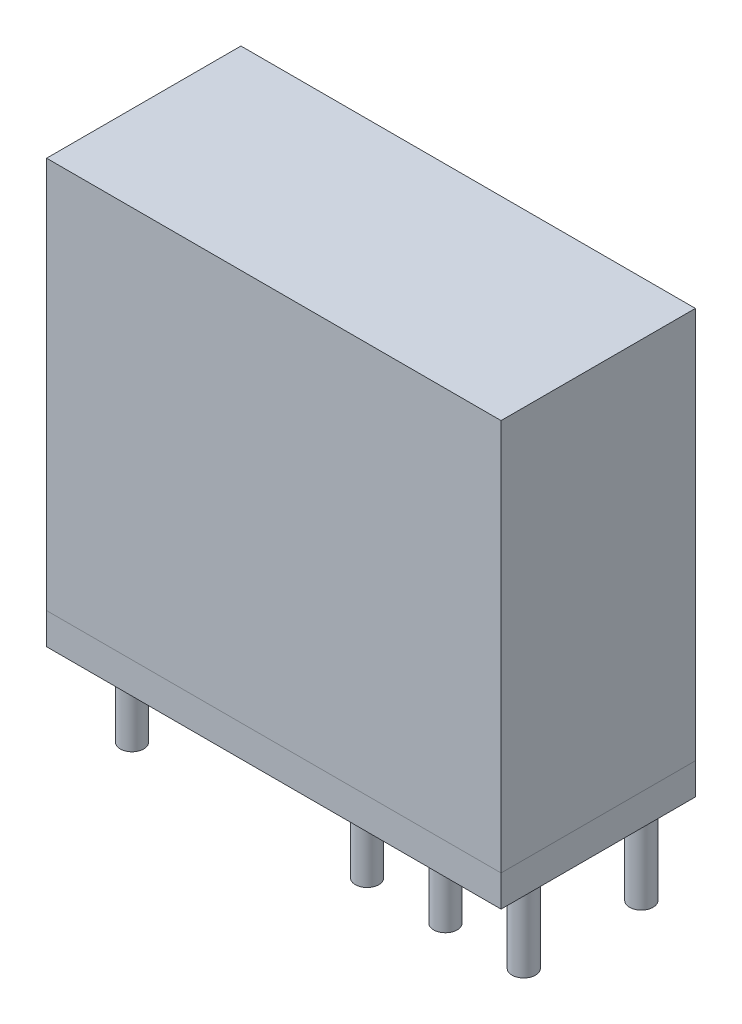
ISO-10303-21;
HEADER;
FILE_DESCRIPTION(('STEP AP214'),'2;1');
FILE_NAME('part.step','',(''),(''),'','','');
FILE_SCHEMA(('AUTOMOTIVE_DESIGN { 1 0 10303 214 1 1 1 1 }'));
ENDSEC;
DATA;
#1=APPLICATION_CONTEXT('core data for automotive mechanical design processes');
#2=APPLICATION_PROTOCOL_DEFINITION('international standard','automotive_design',2000,#1);
#3=PRODUCT_CONTEXT('',#1,'mechanical');
#4=PRODUCT('Part','Part','',(#3));
#5=PRODUCT_RELATED_PRODUCT_CATEGORY('part','',(#4));
#6=PRODUCT_DEFINITION_FORMATION('','',#4);
#7=PRODUCT_DEFINITION_CONTEXT('part definition',#1,'design');
#8=PRODUCT_DEFINITION('design','',#6,#7);
#9=PRODUCT_DEFINITION_SHAPE('','',#8);
#10=(LENGTH_UNIT() NAMED_UNIT(*) SI_UNIT(.MILLI.,.METRE.));
#11=(NAMED_UNIT(*) PLANE_ANGLE_UNIT() SI_UNIT($,.RADIAN.));
#12=(NAMED_UNIT(*) SI_UNIT($,.STERADIAN.) SOLID_ANGLE_UNIT());
#13=UNCERTAINTY_MEASURE_WITH_UNIT(LENGTH_MEASURE(1.E-05),#10,'distance_accuracy_value','');
#14=(GEOMETRIC_REPRESENTATION_CONTEXT(3) GLOBAL_UNCERTAINTY_ASSIGNED_CONTEXT((#13)) GLOBAL_UNIT_ASSIGNED_CONTEXT((#10,
#11,#12)) REPRESENTATION_CONTEXT('',''));
#15=CARTESIAN_POINT('',(0.,0.,0.));
#16=DIRECTION('',(0.,0.,1.));
#17=DIRECTION('',(1.,0.,0.));
#18=AXIS2_PLACEMENT_3D('',#15,#16,#17);
#19=CARTESIAN_POINT('',(0.,0.,0.));
#20=DIRECTION('',(0.,1.,0.));
#21=DIRECTION('',(0.,0.,1.));
#22=AXIS2_PLACEMENT_3D('',#19,#20,#21);
#23=PLANE('',#22);
#24=CARTESIAN_POINT('',(18.,0.,-9.95));
#25=DIRECTION('',(0.,1.,0.));
#26=DIRECTION('',(0.,0.,1.));
#27=AXIS2_PLACEMENT_3D('',#24,#25,#26);
#28=CIRCLE('',#27,0.750000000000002);
#29=CARTESIAN_POINT('',(18.,0.,-9.2));
#30=VERTEX_POINT('',#29);
#31=EDGE_CURVE('E49',#30,#30,#28,.F.);
#32=ORIENTED_EDGE('',*,*,#31,.F.);
#33=EDGE_LOOP('',(#32));
#34=FACE_BOUND('',#33,.T.);
#35=CARTESIAN_POINT('',(28.,0.,-9.95));
#36=DIRECTION('',(0.,1.,0.));
#37=DIRECTION('',(0.,0.,1.));
#38=AXIS2_PLACEMENT_3D('',#35,#36,#37);
#39=CIRCLE('',#38,0.750000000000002);
#40=CARTESIAN_POINT('',(28.,0.,-9.2));
#41=VERTEX_POINT('',#40);
#42=EDGE_CURVE('E224',#41,#41,#39,.F.);
#43=ORIENTED_EDGE('',*,*,#42,.F.);
#44=EDGE_LOOP('',(#43));
#45=FACE_BOUND('',#44,.T.);
#46=CARTESIAN_POINT('',(18.,0.,-2.45));
#47=DIRECTION('',(0.,1.,0.));
#48=DIRECTION('',(0.,0.,1.));
#49=AXIS2_PLACEMENT_3D('',#46,#47,#48);
#50=CIRCLE('',#49,0.750000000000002);
#51=CARTESIAN_POINT('',(18.,0.,-1.7));
#52=VERTEX_POINT('',#51);
#53=EDGE_CURVE('E228',#52,#52,#50,.F.);
#54=ORIENTED_EDGE('',*,*,#53,.F.);
#55=EDGE_LOOP('',(#54));
#56=FACE_BOUND('',#55,.T.);
#57=CARTESIAN_POINT('',(28.,0.,-2.45));
#58=DIRECTION('',(0.,1.,0.));
#59=DIRECTION('',(0.,0.,1.));
#60=AXIS2_PLACEMENT_3D('',#57,#58,#59);
#61=CIRCLE('',#60,0.750000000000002);
#62=CARTESIAN_POINT('',(28.,0.,-1.7));
#63=VERTEX_POINT('',#62);
#64=EDGE_CURVE('E232',#63,#63,#61,.F.);
#65=ORIENTED_EDGE('',*,*,#64,.F.);
#66=EDGE_LOOP('',(#65));
#67=FACE_BOUND('',#66,.T.);
#68=DIRECTION('',(0.,0.,1.));
#69=VECTOR('',#68,1.);
#70=CARTESIAN_POINT('',(0.,0.,-12.4));
#71=LINE('',#70,#69);
#72=CARTESIAN_POINT('',(0.,0.,-12.4));
#73=VERTEX_POINT('',#72);
#74=CARTESIAN_POINT('',(0.,0.,0.));
#75=VERTEX_POINT('',#74);
#76=EDGE_CURVE('E129',#73,#75,#71,.T.);
#77=ORIENTED_EDGE('',*,*,#76,.F.);
#78=DIRECTION('',(-1.,0.,0.));
#79=VECTOR('',#78,1.);
#80=CARTESIAN_POINT('',(0.,0.,-12.4));
#81=LINE('',#80,#79);
#82=CARTESIAN_POINT('',(29.,0.,-12.4));
#83=VERTEX_POINT('',#82);
#84=EDGE_CURVE('E78',#83,#73,#81,.T.);
#85=ORIENTED_EDGE('',*,*,#84,.F.);
#86=DIRECTION('',(0.,0.,-1.));
#87=VECTOR('',#86,1.);
#88=CARTESIAN_POINT('',(29.,0.,-12.4));
#89=LINE('',#88,#87);
#90=CARTESIAN_POINT('',(29.,0.,0.));
#91=VERTEX_POINT('',#90);
#92=EDGE_CURVE('E73',#91,#83,#89,.T.);
#93=ORIENTED_EDGE('',*,*,#92,.F.);
#94=DIRECTION('',(1.,0.,0.));
#95=VECTOR('',#94,1.);
#96=CARTESIAN_POINT('',(0.,0.,0.));
#97=LINE('',#96,#95);
#98=EDGE_CURVE('E132',#75,#91,#97,.T.);
#99=ORIENTED_EDGE('',*,*,#98,.F.);
#100=EDGE_LOOP('',(#77,#85,#93,#99));
#101=FACE_BOUND('',#100,.T.);
#102=CARTESIAN_POINT('',(23.,0.,-2.45));
#103=DIRECTION('',(0.,1.,0.));
#104=DIRECTION('',(0.,0.,1.));
#105=AXIS2_PLACEMENT_3D('',#102,#103,#104);
#106=CIRCLE('',#105,0.750000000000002);
#107=CARTESIAN_POINT('',(23.,0.,-1.7));
#108=VERTEX_POINT('',#107);
#109=EDGE_CURVE('E238',#108,#108,#106,.F.);
#110=ORIENTED_EDGE('',*,*,#109,.F.);
#111=EDGE_LOOP('',(#110));
#112=FACE_BOUND('',#111,.T.);
#113=CARTESIAN_POINT('',(3.,0.,-2.45));
#114=DIRECTION('',(0.,1.,0.));
#115=DIRECTION('',(0.,0.,1.));
#116=AXIS2_PLACEMENT_3D('',#113,#114,#115);
#117=CIRCLE('',#116,0.75);
#118=CARTESIAN_POINT('',(3.,0.,-1.7));
#119=VERTEX_POINT('',#118);
#120=EDGE_CURVE('E242',#119,#119,#117,.F.);
#121=ORIENTED_EDGE('',*,*,#120,.F.);
#122=EDGE_LOOP('',(#121));
#123=FACE_BOUND('',#122,.T.);
#124=CARTESIAN_POINT('',(23.,0.,-9.95));
#125=DIRECTION('',(0.,1.,0.));
#126=DIRECTION('',(0.,0.,1.));
#127=AXIS2_PLACEMENT_3D('',#124,#125,#126);
#128=CIRCLE('',#127,0.750000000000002);
#129=CARTESIAN_POINT('',(23.,0.,-9.2));
#130=VERTEX_POINT('',#129);
#131=EDGE_CURVE('E245',#130,#130,#128,.F.);
#132=ORIENTED_EDGE('',*,*,#131,.F.);
#133=EDGE_LOOP('',(#132));
#134=FACE_BOUND('',#133,.T.);
#135=CARTESIAN_POINT('',(3.,0.,-9.95));
#136=DIRECTION('',(0.,1.,0.));
#137=DIRECTION('',(0.,0.,1.));
#138=AXIS2_PLACEMENT_3D('',#135,#136,#137);
#139=CIRCLE('',#138,0.75);
#140=CARTESIAN_POINT('',(3.,0.,-9.2));
#141=VERTEX_POINT('',#140);
#142=EDGE_CURVE('E11',#141,#141,#139,.F.);
#143=ORIENTED_EDGE('',*,*,#142,.F.);
#144=EDGE_LOOP('',(#143));
#145=FACE_BOUND('',#144,.T.);
#146=ADVANCED_FACE('F39',(#34,#45,#56,#67,#101,#112,#123,#134,#145),#23,.F.);
#147=CARTESIAN_POINT('',(0.,2.,-12.4));
#148=DIRECTION('',(1.,0.,0.));
#149=DIRECTION('',(0.,0.,-1.));
#150=AXIS2_PLACEMENT_3D('',#147,#148,#149);
#151=PLANE('',#150);
#152=ORIENTED_EDGE('',*,*,#76,.T.);
#153=DIRECTION('',(0.,-1.,0.));
#154=VECTOR('',#153,1.);
#155=CARTESIAN_POINT('',(0.,2.,0.));
#156=LINE('',#155,#154);
#157=CARTESIAN_POINT('',(-0.000120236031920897,2.,0.000103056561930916));
#158=VERTEX_POINT('',#157);
#159=EDGE_CURVE('E254',#158,#75,#156,.T.);
#160=ORIENTED_EDGE('',*,*,#159,.F.);
#161=CARTESIAN_POINT('',(-0.000240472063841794,2.00000000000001,-12.4002061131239));
#162=DIRECTION('',(0.,0.,1.));
#163=VECTOR('',#162,1.);
#164=LINE('',#161,#163);
#165=CARTESIAN_POINT('',(-0.000120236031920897,2.,-12.4001030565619));
#166=VERTEX_POINT('',#165);
#167=EDGE_CURVE('E127',#166,#158,#164,.T.);
#168=ORIENTED_EDGE('',*,*,#167,.F.);
#169=DIRECTION('',(0.,-1.,0.));
#170=VECTOR('',#169,1.);
#171=CARTESIAN_POINT('',(0.,2.,-12.4));
#172=LINE('',#171,#170);
#173=EDGE_CURVE('E283',#166,#73,#172,.T.);
#174=ORIENTED_EDGE('',*,*,#173,.T.);
#175=EDGE_LOOP('',(#152,#160,#168,#174));
#176=FACE_BOUND('',#175,.T.);
#177=ADVANCED_FACE('F41',(#176),#151,.F.);
#178=CARTESIAN_POINT('',(0.,2.,0.));
#179=DIRECTION('',(0.,0.,-1.));
#180=DIRECTION('',(-1.,0.,0.));
#181=AXIS2_PLACEMENT_3D('',#178,#179,#180);
#182=PLANE('',#181);
#183=ORIENTED_EDGE('',*,*,#98,.T.);
#184=DIRECTION('',(0.,-1.,0.));
#185=VECTOR('',#184,1.);
#186=CARTESIAN_POINT('',(29.,2.,0.));
#187=LINE('',#186,#185);
#188=CARTESIAN_POINT('',(29.0001202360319,2.,0.000103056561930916));
#189=VERTEX_POINT('',#188);
#190=EDGE_CURVE('E282',#189,#91,#187,.T.);
#191=ORIENTED_EDGE('',*,*,#190,.F.);
#192=CARTESIAN_POINT('',(-0.000240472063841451,2.,0.000206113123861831));
#193=DIRECTION('',(1.,0.,0.));
#194=VECTOR('',#193,1.);
#195=LINE('',#192,#194);
#196=EDGE_CURVE('E84',#158,#189,#195,.T.);
#197=ORIENTED_EDGE('',*,*,#196,.F.);
#198=ORIENTED_EDGE('',*,*,#159,.T.);
#199=EDGE_LOOP('',(#183,#191,#197,#198));
#200=FACE_BOUND('',#199,.T.);
#201=ADVANCED_FACE('F216',(#200),#182,.F.);
#202=CARTESIAN_POINT('',(29.,2.,-12.4));
#203=DIRECTION('',(-1.,0.,0.));
#204=DIRECTION('',(0.,0.,1.));
#205=AXIS2_PLACEMENT_3D('',#202,#203,#204);
#206=PLANE('',#205);
#207=ORIENTED_EDGE('',*,*,#92,.T.);
#208=DIRECTION('',(0.,-1.,0.));
#209=VECTOR('',#208,1.);
#210=CARTESIAN_POINT('',(29.,2.,-12.4));
#211=LINE('',#210,#209);
#212=CARTESIAN_POINT('',(29.0001202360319,2.,-12.4001030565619));
#213=VERTEX_POINT('',#212);
#214=EDGE_CURVE('E57',#213,#83,#211,.T.);
#215=ORIENTED_EDGE('',*,*,#214,.F.);
#216=CARTESIAN_POINT('',(29.0002404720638,2.00000000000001,0.000206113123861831));
#217=DIRECTION('',(0.,0.,-1.));
#218=VECTOR('',#217,1.);
#219=LINE('',#216,#218);
#220=EDGE_CURVE('E289',#189,#213,#219,.T.);
#221=ORIENTED_EDGE('',*,*,#220,.F.);
#222=ORIENTED_EDGE('',*,*,#190,.T.);
#223=EDGE_LOOP('',(#207,#215,#221,#222));
#224=FACE_BOUND('',#223,.T.);
#225=ADVANCED_FACE('F267',(#224),#206,.F.);
#226=CARTESIAN_POINT('',(0.,2.,-12.4));
#227=DIRECTION('',(0.,0.,1.));
#228=DIRECTION('',(1.,0.,0.));
#229=AXIS2_PLACEMENT_3D('',#226,#227,#228);
#230=PLANE('',#229);
#231=ORIENTED_EDGE('',*,*,#84,.T.);
#232=ORIENTED_EDGE('',*,*,#173,.F.);
#233=CARTESIAN_POINT('',(29.0002404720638,2.,-12.4002061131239));
#234=DIRECTION('',(-1.,0.,0.));
#235=VECTOR('',#234,1.);
#236=LINE('',#233,#235);
#237=EDGE_CURVE('E286',#213,#166,#236,.T.);
#238=ORIENTED_EDGE('',*,*,#237,.F.);
#239=ORIENTED_EDGE('',*,*,#214,.T.);
#240=EDGE_LOOP('',(#231,#232,#238,#239));
#241=FACE_BOUND('',#240,.T.);
#242=ADVANCED_FACE('F162',(#241),#230,.F.);
#243=CARTESIAN_POINT('',(-0.000240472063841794,27.,0.000206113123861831));
#244=DIRECTION('',(1.,0.,0.));
#245=DIRECTION('',(0.,0.,-1.));
#246=AXIS2_PLACEMENT_3D('',#243,#244,#245);
#247=PLANE('',#246);
#248=ORIENTED_EDGE('',*,*,#167,.T.);
#249=DIRECTION('',(0.,-1.,0.));
#250=VECTOR('',#249,1.);
#251=CARTESIAN_POINT('',(-0.000240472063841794,27.,0.000206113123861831));
#252=LINE('',#251,#250);
#253=CARTESIAN_POINT('',(-0.000240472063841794,27.,0.000206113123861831));
#254=VERTEX_POINT('',#253);
#255=EDGE_CURVE('E108',#254,#158,#252,.T.);
#256=ORIENTED_EDGE('',*,*,#255,.F.);
#257=DIRECTION('',(0.,0.,1.));
#258=VECTOR('',#257,1.);
#259=CARTESIAN_POINT('',(-0.000240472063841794,27.,0.000206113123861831));
#260=LINE('',#259,#258);
#261=CARTESIAN_POINT('',(-0.000240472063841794,27.,-12.4002061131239));
#262=VERTEX_POINT('',#261);
#263=EDGE_CURVE('E115',#262,#254,#260,.T.);
#264=ORIENTED_EDGE('',*,*,#263,.F.);
#265=DIRECTION('',(0.,-1.,0.));
#266=VECTOR('',#265,1.);
#267=CARTESIAN_POINT('',(-0.000240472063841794,27.,-12.4002061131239));
#268=LINE('',#267,#266);
#269=EDGE_CURVE('E168',#262,#166,#268,.T.);
#270=ORIENTED_EDGE('',*,*,#269,.T.);
#271=EDGE_LOOP('',(#248,#256,#264,#270));
#272=FACE_BOUND('',#271,.T.);
#273=ADVANCED_FACE('F126',(#272),#247,.F.);
#274=CARTESIAN_POINT('',(29.0002404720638,27.,0.000206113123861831));
#275=DIRECTION('',(0.,0.,-1.));
#276=DIRECTION('',(-1.,0.,0.));
#277=AXIS2_PLACEMENT_3D('',#274,#275,#276);
#278=PLANE('',#277);
#279=ORIENTED_EDGE('',*,*,#196,.T.);
#280=DIRECTION('',(0.,-1.,0.));
#281=VECTOR('',#280,1.);
#282=CARTESIAN_POINT('',(29.0002404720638,27.,0.000206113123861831));
#283=LINE('',#282,#281);
#284=CARTESIAN_POINT('',(29.0002404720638,27.,0.000206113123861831));
#285=VERTEX_POINT('',#284);
#286=EDGE_CURVE('E111',#285,#189,#283,.T.);
#287=ORIENTED_EDGE('',*,*,#286,.F.);
#288=DIRECTION('',(1.,0.,0.));
#289=VECTOR('',#288,1.);
#290=CARTESIAN_POINT('',(29.0002404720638,27.,0.000206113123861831));
#291=LINE('',#290,#289);
#292=EDGE_CURVE('E104',#254,#285,#291,.T.);
#293=ORIENTED_EDGE('',*,*,#292,.F.);
#294=ORIENTED_EDGE('',*,*,#255,.T.);
#295=EDGE_LOOP('',(#279,#287,#293,#294));
#296=FACE_BOUND('',#295,.T.);
#297=ADVANCED_FACE('F106',(#296),#278,.F.);
#298=CARTESIAN_POINT('',(29.0002404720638,27.,0.000206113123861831));
#299=DIRECTION('',(-1.,0.,0.));
#300=DIRECTION('',(0.,0.,1.));
#301=AXIS2_PLACEMENT_3D('',#298,#299,#300);
#302=PLANE('',#301);
#303=ORIENTED_EDGE('',*,*,#220,.T.);
#304=DIRECTION('',(0.,-1.,0.));
#305=VECTOR('',#304,1.);
#306=CARTESIAN_POINT('',(29.0002404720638,27.,-12.4002061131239));
#307=LINE('',#306,#305);
#308=CARTESIAN_POINT('',(29.0002404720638,27.,-12.4002061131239));
#309=VERTEX_POINT('',#308);
#310=EDGE_CURVE('E134',#309,#213,#307,.T.);
#311=ORIENTED_EDGE('',*,*,#310,.F.);
#312=DIRECTION('',(0.,0.,-1.));
#313=VECTOR('',#312,1.);
#314=CARTESIAN_POINT('',(29.0002404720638,27.,0.000206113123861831));
#315=LINE('',#314,#313);
#316=EDGE_CURVE('E114',#285,#309,#315,.T.);
#317=ORIENTED_EDGE('',*,*,#316,.F.);
#318=ORIENTED_EDGE('',*,*,#286,.T.);
#319=EDGE_LOOP('',(#303,#311,#317,#318));
#320=FACE_BOUND('',#319,.T.);
#321=ADVANCED_FACE('F156',(#320),#302,.F.);
#322=CARTESIAN_POINT('',(29.0002404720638,27.,-12.4002061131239));
#323=DIRECTION('',(0.,0.,1.));
#324=DIRECTION('',(1.,0.,0.));
#325=AXIS2_PLACEMENT_3D('',#322,#323,#324);
#326=PLANE('',#325);
#327=ORIENTED_EDGE('',*,*,#237,.T.);
#328=ORIENTED_EDGE('',*,*,#269,.F.);
#329=DIRECTION('',(-1.,0.,0.));
#330=VECTOR('',#329,1.);
#331=CARTESIAN_POINT('',(29.0002404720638,27.,-12.4002061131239));
#332=LINE('',#331,#330);
#333=EDGE_CURVE('E120',#309,#262,#332,.T.);
#334=ORIENTED_EDGE('',*,*,#333,.F.);
#335=ORIENTED_EDGE('',*,*,#310,.T.);
#336=EDGE_LOOP('',(#327,#328,#334,#335));
#337=FACE_BOUND('',#336,.T.);
#338=ADVANCED_FACE('F312',(#337),#326,.F.);
#339=CARTESIAN_POINT('',(-0.000240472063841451,27.,-12.4002061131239));
#340=DIRECTION('',(0.,1.,0.));
#341=DIRECTION('',(0.,0.,1.));
#342=AXIS2_PLACEMENT_3D('',#339,#340,#341);
#343=PLANE('',#342);
#344=ORIENTED_EDGE('',*,*,#263,.T.);
#345=ORIENTED_EDGE('',*,*,#292,.T.);
#346=ORIENTED_EDGE('',*,*,#316,.T.);
#347=ORIENTED_EDGE('',*,*,#333,.T.);
#348=EDGE_LOOP('',(#344,#345,#346,#347));
#349=FACE_BOUND('',#348,.T.);
#350=ADVANCED_FACE('F118',(#349),#343,.T.);
#351=CARTESIAN_POINT('',(28.,-5.,-2.45));
#352=DIRECTION('',(0.,1.,0.));
#353=DIRECTION('',(0.,0.,1.));
#354=AXIS2_PLACEMENT_3D('',#351,#352,#353);
#355=CYLINDRICAL_SURFACE('',#354,0.750000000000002);
#356=CARTESIAN_POINT('',(28.,-5.,-2.45));
#357=DIRECTION('',(0.,-1.,0.));
#358=DIRECTION('',(0.,0.,-1.));
#359=AXIS2_PLACEMENT_3D('',#356,#357,#358);
#360=CIRCLE('',#359,0.750000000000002);
#361=CARTESIAN_POINT('',(28.,-5.,-3.2));
#362=VERTEX_POINT('',#361);
#363=EDGE_CURVE('E124',#362,#362,#360,.T.);
#364=ORIENTED_EDGE('',*,*,#363,.F.);
#365=EDGE_LOOP('',(#364));
#366=FACE_BOUND('',#365,.T.);
#367=ORIENTED_EDGE('',*,*,#64,.T.);
#368=EDGE_LOOP('',(#367));
#369=FACE_BOUND('',#368,.T.);
#370=ADVANCED_FACE('F330',(#366,#369),#355,.T.);
#371=CARTESIAN_POINT('',(28.,-5.,-2.45));
#372=DIRECTION('',(0.,-1.,0.));
#373=DIRECTION('',(0.,0.,-1.));
#374=AXIS2_PLACEMENT_3D('',#371,#372,#373);
#375=PLANE('',#374);
#376=ORIENTED_EDGE('',*,*,#363,.T.);
#377=EDGE_LOOP('',(#376));
#378=FACE_BOUND('',#377,.T.);
#379=ADVANCED_FACE('F333',(#378),#375,.T.);
#380=CARTESIAN_POINT('',(23.,-5.,-2.45));
#381=DIRECTION('',(0.,1.,0.));
#382=DIRECTION('',(0.,0.,1.));
#383=AXIS2_PLACEMENT_3D('',#380,#381,#382);
#384=CYLINDRICAL_SURFACE('',#383,0.750000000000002);
#385=CARTESIAN_POINT('',(23.,-5.,-2.45));
#386=DIRECTION('',(0.,-1.,0.));
#387=DIRECTION('',(0.,0.,-1.));
#388=AXIS2_PLACEMENT_3D('',#385,#386,#387);
#389=CIRCLE('',#388,0.750000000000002);
#390=CARTESIAN_POINT('',(23.,-5.,-3.2));
#391=VERTEX_POINT('',#390);
#392=EDGE_CURVE('E180',#391,#391,#389,.T.);
#393=ORIENTED_EDGE('',*,*,#392,.F.);
#394=EDGE_LOOP('',(#393));
#395=FACE_BOUND('',#394,.T.);
#396=ORIENTED_EDGE('',*,*,#109,.T.);
#397=EDGE_LOOP('',(#396));
#398=FACE_BOUND('',#397,.T.);
#399=ADVANCED_FACE('F337',(#395,#398),#384,.T.);
#400=CARTESIAN_POINT('',(23.,-5.,-2.45));
#401=DIRECTION('',(0.,-1.,0.));
#402=DIRECTION('',(0.,0.,-1.));
#403=AXIS2_PLACEMENT_3D('',#400,#401,#402);
#404=PLANE('',#403);
#405=ORIENTED_EDGE('',*,*,#392,.T.);
#406=EDGE_LOOP('',(#405));
#407=FACE_BOUND('',#406,.T.);
#408=ADVANCED_FACE('F341',(#407),#404,.T.);
#409=CARTESIAN_POINT('',(18.,-5.,-2.45));
#410=DIRECTION('',(0.,1.,0.));
#411=DIRECTION('',(0.,0.,1.));
#412=AXIS2_PLACEMENT_3D('',#409,#410,#411);
#413=CYLINDRICAL_SURFACE('',#412,0.750000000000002);
#414=CARTESIAN_POINT('',(18.,-5.,-2.45));
#415=DIRECTION('',(0.,-1.,0.));
#416=DIRECTION('',(0.,0.,-1.));
#417=AXIS2_PLACEMENT_3D('',#414,#415,#416);
#418=CIRCLE('',#417,0.750000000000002);
#419=CARTESIAN_POINT('',(18.,-5.,-3.2));
#420=VERTEX_POINT('',#419);
#421=EDGE_CURVE('E183',#420,#420,#418,.T.);
#422=ORIENTED_EDGE('',*,*,#421,.F.);
#423=EDGE_LOOP('',(#422));
#424=FACE_BOUND('',#423,.T.);
#425=ORIENTED_EDGE('',*,*,#53,.T.);
#426=EDGE_LOOP('',(#425));
#427=FACE_BOUND('',#426,.T.);
#428=ADVANCED_FACE('F345',(#424,#427),#413,.T.);
#429=CARTESIAN_POINT('',(18.,-5.,-2.45));
#430=DIRECTION('',(0.,-1.,0.));
#431=DIRECTION('',(0.,0.,-1.));
#432=AXIS2_PLACEMENT_3D('',#429,#430,#431);
#433=PLANE('',#432);
#434=ORIENTED_EDGE('',*,*,#421,.T.);
#435=EDGE_LOOP('',(#434));
#436=FACE_BOUND('',#435,.T.);
#437=ADVANCED_FACE('F349',(#436),#433,.T.);
#438=CARTESIAN_POINT('',(3.,-5.,-2.45));
#439=DIRECTION('',(0.,1.,0.));
#440=DIRECTION('',(0.,0.,1.));
#441=AXIS2_PLACEMENT_3D('',#438,#439,#440);
#442=CYLINDRICAL_SURFACE('',#441,0.75);
#443=CARTESIAN_POINT('',(3.,-5.,-2.45));
#444=DIRECTION('',(0.,-1.,0.));
#445=DIRECTION('',(0.,0.,-1.));
#446=AXIS2_PLACEMENT_3D('',#443,#444,#445);
#447=CIRCLE('',#446,0.75);
#448=CARTESIAN_POINT('',(3.,-5.,-3.2));
#449=VERTEX_POINT('',#448);
#450=EDGE_CURVE('E186',#449,#449,#447,.T.);
#451=ORIENTED_EDGE('',*,*,#450,.F.);
#452=EDGE_LOOP('',(#451));
#453=FACE_BOUND('',#452,.T.);
#454=ORIENTED_EDGE('',*,*,#120,.T.);
#455=EDGE_LOOP('',(#454));
#456=FACE_BOUND('',#455,.T.);
#457=ADVANCED_FACE('F353',(#453,#456),#442,.T.);
#458=CARTESIAN_POINT('',(3.,-5.,-2.45));
#459=DIRECTION('',(0.,-1.,0.));
#460=DIRECTION('',(0.,0.,-1.));
#461=AXIS2_PLACEMENT_3D('',#458,#459,#460);
#462=PLANE('',#461);
#463=ORIENTED_EDGE('',*,*,#450,.T.);
#464=EDGE_LOOP('',(#463));
#465=FACE_BOUND('',#464,.T.);
#466=ADVANCED_FACE('F357',(#465),#462,.T.);
#467=CARTESIAN_POINT('',(28.,-5.,-9.95));
#468=DIRECTION('',(0.,1.,0.));
#469=DIRECTION('',(0.,0.,1.));
#470=AXIS2_PLACEMENT_3D('',#467,#468,#469);
#471=CYLINDRICAL_SURFACE('',#470,0.750000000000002);
#472=CARTESIAN_POINT('',(28.,-5.,-9.95));
#473=DIRECTION('',(0.,-1.,0.));
#474=DIRECTION('',(0.,0.,1.));
#475=AXIS2_PLACEMENT_3D('',#472,#473,#474);
#476=CIRCLE('',#475,0.750000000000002);
#477=CARTESIAN_POINT('',(28.,-5.,-9.2));
#478=VERTEX_POINT('',#477);
#479=EDGE_CURVE('E189',#478,#478,#476,.T.);
#480=ORIENTED_EDGE('',*,*,#479,.F.);
#481=EDGE_LOOP('',(#480));
#482=FACE_BOUND('',#481,.T.);
#483=ORIENTED_EDGE('',*,*,#42,.T.);
#484=EDGE_LOOP('',(#483));
#485=FACE_BOUND('',#484,.T.);
#486=ADVANCED_FACE('F361',(#482,#485),#471,.T.);
#487=CARTESIAN_POINT('',(28.,-5.,-9.95));
#488=DIRECTION('',(0.,1.,0.));
#489=DIRECTION('',(0.,0.,1.));
#490=AXIS2_PLACEMENT_3D('',#487,#488,#489);
#491=PLANE('',#490);
#492=ORIENTED_EDGE('',*,*,#479,.T.);
#493=EDGE_LOOP('',(#492));
#494=FACE_BOUND('',#493,.T.);
#495=ADVANCED_FACE('F365',(#494),#491,.F.);
#496=CARTESIAN_POINT('',(23.,-5.,-9.95));
#497=DIRECTION('',(0.,1.,0.));
#498=DIRECTION('',(0.,0.,1.));
#499=AXIS2_PLACEMENT_3D('',#496,#497,#498);
#500=CYLINDRICAL_SURFACE('',#499,0.750000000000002);
#501=CARTESIAN_POINT('',(23.,-5.,-9.95));
#502=DIRECTION('',(0.,-1.,0.));
#503=DIRECTION('',(0.,0.,1.));
#504=AXIS2_PLACEMENT_3D('',#501,#502,#503);
#505=CIRCLE('',#504,0.750000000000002);
#506=CARTESIAN_POINT('',(23.,-5.,-9.2));
#507=VERTEX_POINT('',#506);
#508=EDGE_CURVE('E192',#507,#507,#505,.T.);
#509=ORIENTED_EDGE('',*,*,#508,.F.);
#510=EDGE_LOOP('',(#509));
#511=FACE_BOUND('',#510,.T.);
#512=ORIENTED_EDGE('',*,*,#131,.T.);
#513=EDGE_LOOP('',(#512));
#514=FACE_BOUND('',#513,.T.);
#515=ADVANCED_FACE('F369',(#511,#514),#500,.T.);
#516=CARTESIAN_POINT('',(23.,-5.,-9.95));
#517=DIRECTION('',(0.,1.,0.));
#518=DIRECTION('',(0.,0.,1.));
#519=AXIS2_PLACEMENT_3D('',#516,#517,#518);
#520=PLANE('',#519);
#521=ORIENTED_EDGE('',*,*,#508,.T.);
#522=EDGE_LOOP('',(#521));
#523=FACE_BOUND('',#522,.T.);
#524=ADVANCED_FACE('F373',(#523),#520,.F.);
#525=CARTESIAN_POINT('',(18.,-5.,-9.95));
#526=DIRECTION('',(0.,1.,0.));
#527=DIRECTION('',(0.,0.,1.));
#528=AXIS2_PLACEMENT_3D('',#525,#526,#527);
#529=CYLINDRICAL_SURFACE('',#528,0.750000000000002);
#530=CARTESIAN_POINT('',(18.,-5.,-9.95));
#531=DIRECTION('',(0.,-1.,0.));
#532=DIRECTION('',(0.,0.,1.));
#533=AXIS2_PLACEMENT_3D('',#530,#531,#532);
#534=CIRCLE('',#533,0.750000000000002);
#535=CARTESIAN_POINT('',(18.,-5.,-9.2));
#536=VERTEX_POINT('',#535);
#537=EDGE_CURVE('E195',#536,#536,#534,.T.);
#538=ORIENTED_EDGE('',*,*,#537,.F.);
#539=EDGE_LOOP('',(#538));
#540=FACE_BOUND('',#539,.T.);
#541=ORIENTED_EDGE('',*,*,#31,.T.);
#542=EDGE_LOOP('',(#541));
#543=FACE_BOUND('',#542,.T.);
#544=ADVANCED_FACE('F377',(#540,#543),#529,.T.);
#545=CARTESIAN_POINT('',(18.,-5.,-9.95));
#546=DIRECTION('',(0.,1.,0.));
#547=DIRECTION('',(0.,0.,1.));
#548=AXIS2_PLACEMENT_3D('',#545,#546,#547);
#549=PLANE('',#548);
#550=ORIENTED_EDGE('',*,*,#537,.T.);
#551=EDGE_LOOP('',(#550));
#552=FACE_BOUND('',#551,.T.);
#553=ADVANCED_FACE('F207',(#552),#549,.F.);
#554=CARTESIAN_POINT('',(3.,-5.,-9.95));
#555=DIRECTION('',(0.,1.,0.));
#556=DIRECTION('',(0.,0.,1.));
#557=AXIS2_PLACEMENT_3D('',#554,#555,#556);
#558=CYLINDRICAL_SURFACE('',#557,0.75);
#559=CARTESIAN_POINT('',(3.,-5.,-9.95));
#560=DIRECTION('',(0.,-1.,0.));
#561=DIRECTION('',(0.,0.,1.));
#562=AXIS2_PLACEMENT_3D('',#559,#560,#561);
#563=CIRCLE('',#562,0.75);
#564=CARTESIAN_POINT('',(3.,-5.,-9.2));
#565=VERTEX_POINT('',#564);
#566=EDGE_CURVE('E198',#565,#565,#563,.T.);
#567=ORIENTED_EDGE('',*,*,#566,.F.);
#568=EDGE_LOOP('',(#567));
#569=FACE_BOUND('',#568,.T.);
#570=ORIENTED_EDGE('',*,*,#142,.T.);
#571=EDGE_LOOP('',(#570));
#572=FACE_BOUND('',#571,.T.);
#573=ADVANCED_FACE('F204',(#569,#572),#558,.T.);
#574=CARTESIAN_POINT('',(3.,-5.,-9.95));
#575=DIRECTION('',(0.,1.,0.));
#576=DIRECTION('',(0.,0.,1.));
#577=AXIS2_PLACEMENT_3D('',#574,#575,#576);
#578=PLANE('',#577);
#579=ORIENTED_EDGE('',*,*,#566,.T.);
#580=EDGE_LOOP('',(#579));
#581=FACE_BOUND('',#580,.T.);
#582=ADVANCED_FACE('F202',(#581),#578,.F.);
#583=CLOSED_SHELL('',(#146,#177,#201,#225,#242,#273,#297,#321,#338,#350,#370,#379,#399,#408,
#428,#437,#457,#466,#486,#495,#515,#524,#544,#553,#573,#582));
#584=MANIFOLD_SOLID_BREP('B2',#583);
#585=ADVANCED_BREP_SHAPE_REPRESENTATION('',(#18,#584),#14);
#586=SHAPE_DEFINITION_REPRESENTATION(#9,#585);
ENDSEC;
END-ISO-10303-21;
